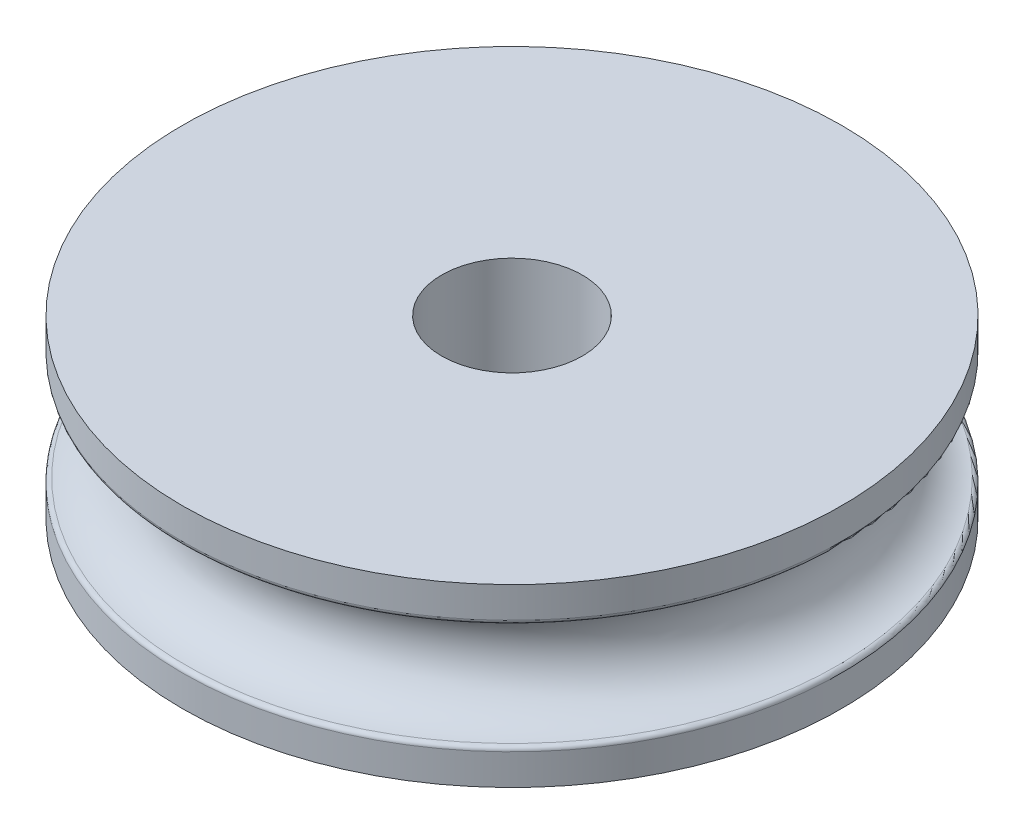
ISO-10303-21;
HEADER;
FILE_DESCRIPTION(('STEP AP214'),'2;1');
FILE_NAME('part.step','',(''),(''),'','','');
FILE_SCHEMA(('AUTOMOTIVE_DESIGN { 1 0 10303 214 1 1 1 1 }'));
ENDSEC;
DATA;
#1=APPLICATION_CONTEXT('core data for automotive mechanical design processes');
#2=APPLICATION_PROTOCOL_DEFINITION('international standard','automotive_design',2000,#1);
#3=PRODUCT_CONTEXT('',#1,'mechanical');
#4=PRODUCT('Part','Part','',(#3));
#5=PRODUCT_RELATED_PRODUCT_CATEGORY('part','',(#4));
#6=PRODUCT_DEFINITION_FORMATION('','',#4);
#7=PRODUCT_DEFINITION_CONTEXT('part definition',#1,'design');
#8=PRODUCT_DEFINITION('design','',#6,#7);
#9=PRODUCT_DEFINITION_SHAPE('','',#8);
#10=(LENGTH_UNIT() NAMED_UNIT(*) SI_UNIT(.MILLI.,.METRE.));
#11=(NAMED_UNIT(*) PLANE_ANGLE_UNIT() SI_UNIT($,.RADIAN.));
#12=(NAMED_UNIT(*) SI_UNIT($,.STERADIAN.) SOLID_ANGLE_UNIT());
#13=UNCERTAINTY_MEASURE_WITH_UNIT(LENGTH_MEASURE(1.E-05),#10,'distance_accuracy_value','');
#14=(GEOMETRIC_REPRESENTATION_CONTEXT(3) GLOBAL_UNCERTAINTY_ASSIGNED_CONTEXT((#13)) GLOBAL_UNIT_ASSIGNED_CONTEXT((#10,
#11,#12)) REPRESENTATION_CONTEXT('',''));
#15=CARTESIAN_POINT('',(0.,0.,0.));
#16=DIRECTION('',(0.,0.,1.));
#17=DIRECTION('',(1.,0.,0.));
#18=AXIS2_PLACEMENT_3D('',#15,#16,#17);
#19=CARTESIAN_POINT('',(0.,0.,0.));
#20=DIRECTION('',(0.,-1.,0.));
#21=DIRECTION('',(0.,0.,-1.));
#22=AXIS2_PLACEMENT_3D('',#19,#20,#21);
#23=PLANE('',#22);
#24=CARTESIAN_POINT('',(0.,0.,0.));
#25=DIRECTION('',(0.,1.,0.));
#26=DIRECTION('',(0.,0.,1.));
#27=AXIS2_PLACEMENT_3D('',#24,#25,#26);
#28=CIRCLE('',#27,1.6);
#29=CARTESIAN_POINT('',(0.,0.,1.6));
#30=VERTEX_POINT('',#29);
#31=EDGE_CURVE('E57',#30,#30,#28,.T.);
#32=ORIENTED_EDGE('',*,*,#31,.T.);
#33=EDGE_LOOP('',(#32));
#34=FACE_BOUND('',#33,.T.);
#35=CARTESIAN_POINT('',(0.,0.,0.));
#36=DIRECTION('',(0.,-1.,0.));
#37=DIRECTION('',(0.,0.,-1.));
#38=AXIS2_PLACEMENT_3D('',#35,#36,#37);
#39=CIRCLE('',#38,7.5);
#40=CARTESIAN_POINT('',(0.,0.,-7.5));
#41=VERTEX_POINT('',#40);
#42=EDGE_CURVE('E10',#41,#41,#39,.T.);
#43=ORIENTED_EDGE('',*,*,#42,.T.);
#44=EDGE_LOOP('',(#43));
#45=FACE_BOUND('',#44,.T.);
#46=ADVANCED_FACE('F32',(#34,#45),#23,.T.);
#47=CARTESIAN_POINT('',(0.,0.,0.));
#48=DIRECTION('',(0.,-1.,0.));
#49=DIRECTION('',(0.,0.,-1.));
#50=AXIS2_PLACEMENT_3D('',#47,#48,#49);
#51=CYLINDRICAL_SURFACE('',#50,7.5);
#52=CARTESIAN_POINT('',(0.,0.703851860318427,0.));
#53=DIRECTION('',(0.,-1.,0.));
#54=DIRECTION('',(0.,0.,-1.));
#55=AXIS2_PLACEMENT_3D('',#52,#53,#54);
#56=CIRCLE('',#55,7.5);
#57=CARTESIAN_POINT('',(0.,0.703851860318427,-7.5));
#58=VERTEX_POINT('',#57);
#59=EDGE_CURVE('E38',#58,#58,#56,.T.);
#60=ORIENTED_EDGE('',*,*,#59,.T.);
#61=EDGE_LOOP('',(#60));
#62=FACE_BOUND('',#61,.T.);
#63=ORIENTED_EDGE('',*,*,#42,.F.);
#64=EDGE_LOOP('',(#63));
#65=FACE_BOUND('',#64,.T.);
#66=ADVANCED_FACE('F98',(#62,#65),#51,.T.);
#67=CARTESIAN_POINT('',(0.,0.703851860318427,0.));
#68=DIRECTION('',(0.,-1.,0.));
#69=DIRECTION('',(0.,0.,-1.));
#70=AXIS2_PLACEMENT_3D('',#67,#68,#69);
#71=TOROIDAL_SURFACE('',#70,7.4,0.1);
#72=CARTESIAN_POINT('',(0.,0.803555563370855,0.));
#73=DIRECTION('',(0.,-1.,0.));
#74=DIRECTION('',(0.,0.,-1.));
#75=AXIS2_PLACEMENT_3D('',#72,#73,#74);
#76=CIRCLE('',#75,7.40769230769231);
#77=CARTESIAN_POINT('',(0.,0.803555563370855,-7.40769230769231));
#78=VERTEX_POINT('',#77);
#79=EDGE_CURVE('E42',#78,#78,#76,.T.);
#80=ORIENTED_EDGE('',*,*,#79,.T.);
#81=EDGE_LOOP('',(#80));
#82=FACE_BOUND('',#81,.T.);
#83=ORIENTED_EDGE('',*,*,#59,.F.);
#84=EDGE_LOOP('',(#83));
#85=FACE_BOUND('',#84,.T.);
#86=ADVANCED_FACE('F92',(#82,#85),#71,.T.);
#87=CARTESIAN_POINT('',(0.,2.,0.));
#88=DIRECTION('',(0.,-1.,0.));
#89=DIRECTION('',(0.,0.,-1.));
#90=AXIS2_PLACEMENT_3D('',#87,#88,#89);
#91=TOROIDAL_SURFACE('',#90,7.5,1.2);
#92=CARTESIAN_POINT('',(0.,3.19644443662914,0.));
#93=DIRECTION('',(0.,-1.,0.));
#94=DIRECTION('',(0.,0.,-1.));
#95=AXIS2_PLACEMENT_3D('',#92,#93,#94);
#96=CIRCLE('',#95,7.40769230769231);
#97=CARTESIAN_POINT('',(0.,3.19644443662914,-7.40769230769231));
#98=VERTEX_POINT('',#97);
#99=EDGE_CURVE('E46',#98,#98,#96,.T.);
#100=ORIENTED_EDGE('',*,*,#99,.T.);
#101=EDGE_LOOP('',(#100));
#102=FACE_BOUND('',#101,.T.);
#103=ORIENTED_EDGE('',*,*,#79,.F.);
#104=EDGE_LOOP('',(#103));
#105=FACE_BOUND('',#104,.T.);
#106=ADVANCED_FACE('F86',(#102,#105),#91,.F.);
#107=CARTESIAN_POINT('',(0.,3.29614813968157,0.));
#108=DIRECTION('',(0.,-1.,0.));
#109=DIRECTION('',(0.,0.,-1.));
#110=AXIS2_PLACEMENT_3D('',#107,#108,#109);
#111=TOROIDAL_SURFACE('',#110,7.4,0.1);
#112=CARTESIAN_POINT('',(0.,3.29614813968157,0.));
#113=DIRECTION('',(0.,-1.,0.));
#114=DIRECTION('',(0.,0.,-1.));
#115=AXIS2_PLACEMENT_3D('',#112,#113,#114);
#116=CIRCLE('',#115,7.5);
#117=CARTESIAN_POINT('',(0.,3.29614813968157,-7.5));
#118=VERTEX_POINT('',#117);
#119=EDGE_CURVE('E51',#118,#118,#116,.T.);
#120=ORIENTED_EDGE('',*,*,#119,.T.);
#121=EDGE_LOOP('',(#120));
#122=FACE_BOUND('',#121,.T.);
#123=ORIENTED_EDGE('',*,*,#99,.F.);
#124=EDGE_LOOP('',(#123));
#125=FACE_BOUND('',#124,.T.);
#126=ADVANCED_FACE('F80',(#122,#125),#111,.T.);
#127=CARTESIAN_POINT('',(0.,0.,0.));
#128=DIRECTION('',(0.,-1.,0.));
#129=DIRECTION('',(0.,0.,-1.));
#130=AXIS2_PLACEMENT_3D('',#127,#128,#129);
#131=CYLINDRICAL_SURFACE('',#130,7.5);
#132=CARTESIAN_POINT('',(0.,4.,0.));
#133=DIRECTION('',(0.,-1.,0.));
#134=DIRECTION('',(0.,0.,-1.));
#135=AXIS2_PLACEMENT_3D('',#132,#133,#134);
#136=CIRCLE('',#135,7.5);
#137=CARTESIAN_POINT('',(0.,4.,-7.5));
#138=VERTEX_POINT('',#137);
#139=EDGE_CURVE('E54',#138,#138,#136,.T.);
#140=ORIENTED_EDGE('',*,*,#139,.T.);
#141=EDGE_LOOP('',(#140));
#142=FACE_BOUND('',#141,.T.);
#143=ORIENTED_EDGE('',*,*,#119,.F.);
#144=EDGE_LOOP('',(#143));
#145=FACE_BOUND('',#144,.T.);
#146=ADVANCED_FACE('F74',(#142,#145),#131,.T.);
#147=CARTESIAN_POINT('',(0.,4.,0.));
#148=DIRECTION('',(0.,1.,0.));
#149=DIRECTION('',(0.,0.,1.));
#150=AXIS2_PLACEMENT_3D('',#147,#148,#149);
#151=PLANE('',#150);
#152=CARTESIAN_POINT('',(0.,4.,0.));
#153=DIRECTION('',(0.,1.,0.));
#154=DIRECTION('',(0.,0.,1.));
#155=AXIS2_PLACEMENT_3D('',#152,#153,#154);
#156=CIRCLE('',#155,1.6);
#157=CARTESIAN_POINT('',(0.,4.,1.6));
#158=VERTEX_POINT('',#157);
#159=EDGE_CURVE('E58',#158,#158,#156,.T.);
#160=ORIENTED_EDGE('',*,*,#159,.F.);
#161=EDGE_LOOP('',(#160));
#162=FACE_BOUND('',#161,.T.);
#163=ORIENTED_EDGE('',*,*,#139,.F.);
#164=EDGE_LOOP('',(#163));
#165=FACE_BOUND('',#164,.T.);
#166=ADVANCED_FACE('F68',(#162,#165),#151,.T.);
#167=CARTESIAN_POINT('',(0.,0.,0.));
#168=DIRECTION('',(0.,1.,0.));
#169=DIRECTION('',(0.,0.,1.));
#170=AXIS2_PLACEMENT_3D('',#167,#168,#169);
#171=CYLINDRICAL_SURFACE('',#170,1.6);
#172=ORIENTED_EDGE('',*,*,#31,.F.);
#173=EDGE_LOOP('',(#172));
#174=FACE_BOUND('',#173,.T.);
#175=ORIENTED_EDGE('',*,*,#159,.T.);
#176=EDGE_LOOP('',(#175));
#177=FACE_BOUND('',#176,.T.);
#178=ADVANCED_FACE('F65',(#174,#177),#171,.F.);
#179=CLOSED_SHELL('',(#46,#66,#86,#106,#126,#146,#166,#178));
#180=MANIFOLD_SOLID_BREP('B2',#179);
#181=ADVANCED_BREP_SHAPE_REPRESENTATION('',(#18,#180),#14);
#182=SHAPE_DEFINITION_REPRESENTATION(#9,#181);
ENDSEC;
END-ISO-10303-21;
